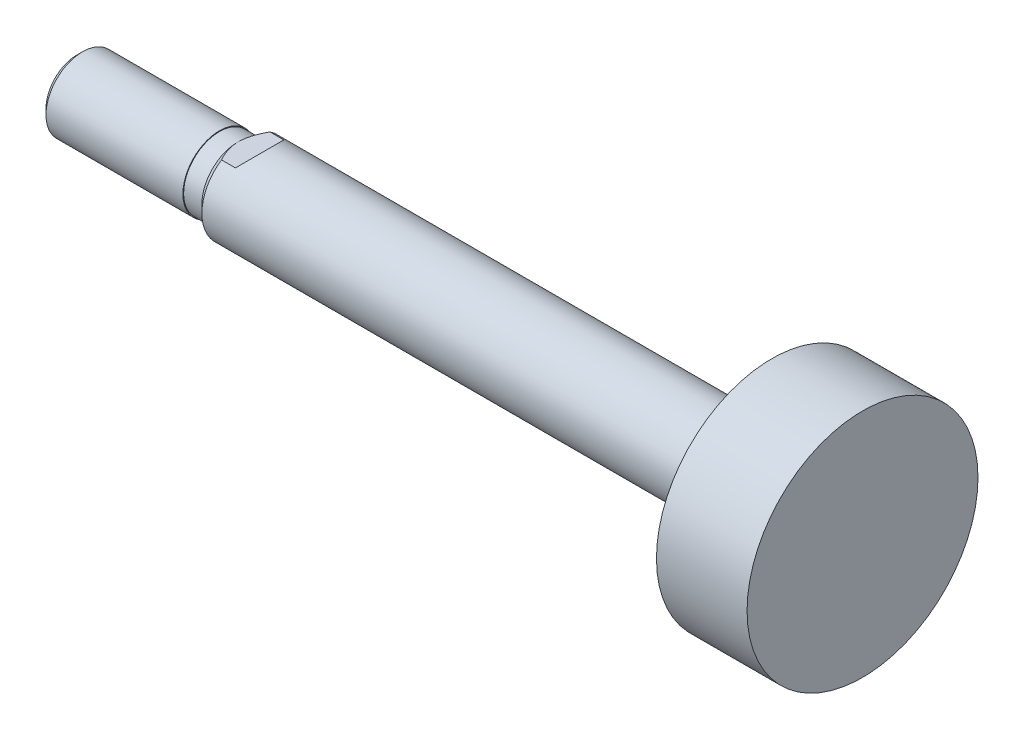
ISO-10303-21;
HEADER;
FILE_DESCRIPTION(('STEP AP214'),'2;1');
FILE_NAME('part.step','',(''),(''),'','','');
FILE_SCHEMA(('AUTOMOTIVE_DESIGN { 1 0 10303 214 1 1 1 1 }'));
ENDSEC;
DATA;
#1=APPLICATION_CONTEXT('core data for automotive mechanical design processes');
#2=APPLICATION_PROTOCOL_DEFINITION('international standard','automotive_design',2000,#1);
#3=PRODUCT_CONTEXT('',#1,'mechanical');
#4=PRODUCT('Part','Part','',(#3));
#5=PRODUCT_RELATED_PRODUCT_CATEGORY('part','',(#4));
#6=PRODUCT_DEFINITION_FORMATION('','',#4);
#7=PRODUCT_DEFINITION_CONTEXT('part definition',#1,'design');
#8=PRODUCT_DEFINITION('design','',#6,#7);
#9=PRODUCT_DEFINITION_SHAPE('','',#8);
#10=(LENGTH_UNIT() NAMED_UNIT(*) SI_UNIT(.MILLI.,.METRE.));
#11=(NAMED_UNIT(*) PLANE_ANGLE_UNIT() SI_UNIT($,.RADIAN.));
#12=(NAMED_UNIT(*) SI_UNIT($,.STERADIAN.) SOLID_ANGLE_UNIT());
#13=UNCERTAINTY_MEASURE_WITH_UNIT(LENGTH_MEASURE(1.E-05),#10,'distance_accuracy_value','');
#14=(GEOMETRIC_REPRESENTATION_CONTEXT(3) GLOBAL_UNCERTAINTY_ASSIGNED_CONTEXT((#13)) GLOBAL_UNIT_ASSIGNED_CONTEXT((#10,
#11,#12)) REPRESENTATION_CONTEXT('',''));
#15=CARTESIAN_POINT('',(0.,0.,0.));
#16=DIRECTION('',(0.,0.,1.));
#17=DIRECTION('',(1.,0.,0.));
#18=AXIS2_PLACEMENT_3D('',#15,#16,#17);
#19=CARTESIAN_POINT('',(-27.,0.,0.));
#20=DIRECTION('',(1.,0.,0.));
#21=DIRECTION('',(0.,0.,-1.));
#22=AXIS2_PLACEMENT_3D('',#19,#20,#21);
#23=PLANE('',#22);
#24=CARTESIAN_POINT('',(-27.,0.,0.));
#25=DIRECTION('',(-1.,0.,0.));
#26=DIRECTION('',(0.,0.,1.));
#27=AXIS2_PLACEMENT_3D('',#24,#25,#26);
#28=CIRCLE('',#27,4.233);
#29=CARTESIAN_POINT('',(-27.,0.,4.233));
#30=VERTEX_POINT('',#29);
#31=EDGE_CURVE('E61',#30,#30,#28,.T.);
#32=ORIENTED_EDGE('',*,*,#31,.T.);
#33=EDGE_LOOP('',(#32));
#34=FACE_BOUND('',#33,.T.);
#35=ADVANCED_FACE('F16',(#34),#23,.F.);
#36=CARTESIAN_POINT('',(-26.233,0.,0.));
#37=DIRECTION('',(1.,0.,0.));
#38=DIRECTION('',(0.,0.,-1.));
#39=AXIS2_PLACEMENT_3D('',#36,#37,#38);
#40=CONICAL_SURFACE('',#39,5.,0.785398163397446);
#41=ORIENTED_EDGE('',*,*,#31,.F.);
#42=EDGE_LOOP('',(#41));
#43=FACE_BOUND('',#42,.T.);
#44=CARTESIAN_POINT('',(-26.233,0.,0.));
#45=DIRECTION('',(-1.,0.,0.));
#46=DIRECTION('',(0.,0.,1.));
#47=AXIS2_PLACEMENT_3D('',#44,#45,#46);
#48=CIRCLE('',#47,5.);
#49=CARTESIAN_POINT('',(-26.233,0.,5.));
#50=VERTEX_POINT('',#49);
#51=EDGE_CURVE('E141',#50,#50,#48,.T.);
#52=ORIENTED_EDGE('',*,*,#51,.T.);
#53=EDGE_LOOP('',(#52));
#54=FACE_BOUND('',#53,.T.);
#55=ADVANCED_FACE('F131',(#43,#54),#40,.T.);
#56=CARTESIAN_POINT('',(80.5,0.,0.));
#57=DIRECTION('',(-1.,0.,0.));
#58=DIRECTION('',(0.,0.,1.));
#59=AXIS2_PLACEMENT_3D('',#56,#57,#58);
#60=CYLINDRICAL_SURFACE('',#59,5.);
#61=ORIENTED_EDGE('',*,*,#51,.F.);
#62=EDGE_LOOP('',(#61));
#63=FACE_BOUND('',#62,.T.);
#64=CARTESIAN_POINT('',(-7.5,0.,0.));
#65=DIRECTION('',(-1.,0.,0.));
#66=DIRECTION('',(0.,0.,1.));
#67=AXIS2_PLACEMENT_3D('',#64,#65,#66);
#68=CIRCLE('',#67,5.);
#69=CARTESIAN_POINT('',(-7.5,0.,5.));
#70=VERTEX_POINT('',#69);
#71=EDGE_CURVE('E144',#70,#70,#68,.T.);
#72=ORIENTED_EDGE('',*,*,#71,.T.);
#73=EDGE_LOOP('',(#72));
#74=FACE_BOUND('',#73,.T.);
#75=ADVANCED_FACE('F137',(#63,#74),#60,.T.);
#76=CARTESIAN_POINT('',(-7.5,5.,0.));
#77=DIRECTION('',(-1.,0.,0.));
#78=DIRECTION('',(0.,0.,1.));
#79=AXIS2_PLACEMENT_3D('',#76,#77,#78);
#80=PLANE('',#79);
#81=ORIENTED_EDGE('',*,*,#71,.F.);
#82=EDGE_LOOP('',(#81));
#83=FACE_BOUND('',#82,.T.);
#84=CARTESIAN_POINT('',(-7.5,0.,0.));
#85=DIRECTION('',(-1.,0.,0.));
#86=DIRECTION('',(0.,0.,1.));
#87=AXIS2_PLACEMENT_3D('',#84,#85,#86);
#88=CIRCLE('',#87,4.9);
#89=CARTESIAN_POINT('',(-7.5,0.,4.9));
#90=VERTEX_POINT('',#89);
#91=EDGE_CURVE('E149',#90,#90,#88,.T.);
#92=ORIENTED_EDGE('',*,*,#91,.T.);
#93=EDGE_LOOP('',(#92));
#94=FACE_BOUND('',#93,.T.);
#95=ADVANCED_FACE('F174',(#83,#94),#80,.F.);
#96=CARTESIAN_POINT('',(80.5,0.,0.));
#97=DIRECTION('',(-1.,0.,0.));
#98=DIRECTION('',(0.,0.,1.));
#99=AXIS2_PLACEMENT_3D('',#96,#97,#98);
#100=CYLINDRICAL_SURFACE('',#99,4.9);
#101=ORIENTED_EDGE('',*,*,#91,.F.);
#102=EDGE_LOOP('',(#101));
#103=FACE_BOUND('',#102,.T.);
#104=CARTESIAN_POINT('',(-5.,0.,0.));
#105=DIRECTION('',(-1.,0.,0.));
#106=DIRECTION('',(0.,0.,1.));
#107=AXIS2_PLACEMENT_3D('',#104,#105,#106);
#108=CIRCLE('',#107,4.9);
#109=CARTESIAN_POINT('',(-5.,0.,4.9));
#110=VERTEX_POINT('',#109);
#111=EDGE_CURVE('E152',#110,#110,#108,.T.);
#112=ORIENTED_EDGE('',*,*,#111,.T.);
#113=EDGE_LOOP('',(#112));
#114=FACE_BOUND('',#113,.T.);
#115=ADVANCED_FACE('F128',(#103,#114),#100,.T.);
#116=CARTESIAN_POINT('',(-3.9,0.,0.));
#117=DIRECTION('',(1.,0.,0.));
#118=DIRECTION('',(0.,0.,-1.));
#119=AXIS2_PLACEMENT_3D('',#116,#117,#118);
#120=CONICAL_SURFACE('',#119,6.,0.785398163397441);
#121=ORIENTED_EDGE('',*,*,#111,.F.);
#122=EDGE_LOOP('',(#121));
#123=FACE_BOUND('',#122,.T.);
#124=CARTESIAN_POINT('',(-3.9,0.,0.));
#125=DIRECTION('',(-1.,0.,0.));
#126=DIRECTION('',(0.,0.,1.));
#127=AXIS2_PLACEMENT_3D('',#124,#125,#126);
#128=CIRCLE('',#127,6.);
#129=CARTESIAN_POINT('',(-3.9,-5.,3.3166247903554));
#130=VERTEX_POINT('',#129);
#131=CARTESIAN_POINT('',(-3.9,5.,3.3166247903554));
#132=VERTEX_POINT('',#131);
#133=EDGE_CURVE('E72',#130,#132,#128,.T.);
#134=ORIENTED_EDGE('',*,*,#133,.T.);
#135=CARTESIAN_POINT('',(1.07892018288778,5.,-9.77428710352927));
#136=CARTESIAN_POINT('',(0.878035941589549,5.,-9.54860982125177));
#137=CARTESIAN_POINT('',(0.677920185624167,5.,-9.32224200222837));
#138=CARTESIAN_POINT('',(0.279635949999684,5.,-8.86775900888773));
#139=CARTESIAN_POINT('',(0.0814676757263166,5.,-8.63964365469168));
#140=CARTESIAN_POINT('',(-0.313308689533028,5.,-8.18036960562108));
#141=CARTESIAN_POINT('',(-0.509906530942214,5.,-7.94920208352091));
#142=CARTESIAN_POINT('',(-0.900051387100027,5.,-7.48432142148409));
#143=CARTESIAN_POINT('',(-1.09359854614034,5.,-7.25060840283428));
#144=CARTESIAN_POINT('',(-1.48835087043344,5.,-6.76585825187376));
#145=CARTESIAN_POINT('',(-1.6893159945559,5.,-6.51462493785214));
#146=CARTESIAN_POINT('',(-2.08546899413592,5.,-6.00765585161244));
#147=CARTESIAN_POINT('',(-2.28065723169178,5.,-5.75192036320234));
#148=CARTESIAN_POINT('',(-2.66290213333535,5.,-5.23506412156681));
#149=CARTESIAN_POINT('',(-2.84997212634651,5.,-4.97395332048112));
#150=CARTESIAN_POINT('',(-3.12233081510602,5.,-4.57668241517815));
#151=CARTESIAN_POINT('',(-3.2117316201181,5.,-4.44334228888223));
#152=CARTESIAN_POINT('',(-3.38723127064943,5.,-4.17451015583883));
#153=CARTESIAN_POINT('',(-3.47333024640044,5.,-4.03901823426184));
#154=CARTESIAN_POINT('',(-3.67534376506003,5.,-3.71068803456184));
#155=CARTESIAN_POINT('',(-3.78935116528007,5.,-3.51666515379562));
#156=CARTESIAN_POINT('',(-4.00718531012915,5.,-3.12284812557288));
#157=CARTESIAN_POINT('',(-4.1110088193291,5.,-2.92305216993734));
#158=CARTESIAN_POINT('',(-4.30424975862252,5.,-2.51866994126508));
#159=CARTESIAN_POINT('',(-4.3937848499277,5.,-2.31414058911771));
#160=CARTESIAN_POINT('',(-4.55522602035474,5.,-1.89821804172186));
#161=CARTESIAN_POINT('',(-4.62714362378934,5.,-1.68682943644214));
#162=CARTESIAN_POINT('',(-4.72886159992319,5.,-1.32670974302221));
#163=CARTESIAN_POINT('',(-4.76476782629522,5.,-1.1797063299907));
#164=CARTESIAN_POINT('',(-4.82465481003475,5.,-0.883274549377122));
#165=CARTESIAN_POINT('',(-4.84863763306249,5.,-0.733846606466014));
#166=CARTESIAN_POINT('',(-4.88340335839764,5.,-0.433971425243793));
#167=CARTESIAN_POINT('',(-4.89423215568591,5.,-0.283529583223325));
#168=CARTESIAN_POINT('',(-4.90223584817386,5.,0.0177243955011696));
#169=CARTESIAN_POINT('',(-4.89941068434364,5.,0.168536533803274));
#170=CARTESIAN_POINT('',(-4.88031719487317,5.,0.468530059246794));
#171=CARTESIAN_POINT('',(-4.86411662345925,5.,0.617715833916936));
#172=CARTESIAN_POINT('',(-4.81922499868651,5.,0.914203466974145));
#173=CARTESIAN_POINT('',(-4.79053097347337,5.,1.06150486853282));
#174=CARTESIAN_POINT('',(-4.72161195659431,5.,1.35510557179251));
#175=CARTESIAN_POINT('',(-4.68126055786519,5.,1.50137483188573));
#176=CARTESIAN_POINT('',(-4.5907626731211,5.,1.79078173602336));
#177=CARTESIAN_POINT('',(-4.5406180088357,5.,1.93391995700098));
#178=CARTESIAN_POINT('',(-4.41376926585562,5.,2.26480330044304));
#179=CARTESIAN_POINT('',(-4.3338135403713,5.,2.45129631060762));
#180=CARTESIAN_POINT('',(-4.16239977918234,5.,2.81895921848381));
#181=CARTESIAN_POINT('',(-4.07093540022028,5.,3.00012611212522));
#182=CARTESIAN_POINT('',(-3.8787622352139,5.,3.35830658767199));
#183=CARTESIAN_POINT('',(-3.77802077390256,5.,3.53530249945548));
#184=CARTESIAN_POINT('',(-3.56958820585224,5.,3.88507768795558));
#185=CARTESIAN_POINT('',(-3.46189845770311,5.,4.05785777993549));
#186=CARTESIAN_POINT('',(-3.24655917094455,5.,4.39131527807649));
#187=CARTESIAN_POINT('',(-3.13917660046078,5.,4.55216598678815));
#188=CARTESIAN_POINT('',(-2.92041956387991,5.,4.87114009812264));
#189=CARTESIAN_POINT('',(-2.80904477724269,5.,5.02926328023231));
#190=CARTESIAN_POINT('',(-2.58406115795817,5.,5.34178281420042));
#191=CARTESIAN_POINT('',(-2.47048084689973,5.,5.49619976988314));
#192=CARTESIAN_POINT('',(-2.24070675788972,5.,5.8030152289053));
#193=CARTESIAN_POINT('',(-2.12451368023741,5.,5.95541425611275));
#194=CARTESIAN_POINT('',(-2.00726604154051,5.,6.10698365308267));
#195=B_SPLINE_CURVE_WITH_KNOTS('',3,(#135,#136,#137,#138,#139,#140,#141,#142,#143,#144,#145,
#146,#147,#148,#149,#150,#151,#152,#153,#154,#155,#156,#157,#158,#159,#160,#161,#162,#163,#164,
#165,#166,#167,#168,#169,#170,#171,#172,#173,#174,#175,#176,#177,#178,#179,#180,#181,#182,#183,
#184,#185,#186,#187,#188,#189,#190,#191,#192,#193,#194),.UNSPECIFIED.,.F.,.F.,(4,2,2,2,2,2,2,2,
2,2,2,2,2,2,2,2,2,2,2,2,2,2,2,2,2,2,2,2,2,4),(0.,0.906406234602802,1.81290705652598,
2.72327150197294,3.63359275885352,4.59869384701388,5.56373431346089,6.52712524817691,
7.0086960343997,7.49024780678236,8.1651272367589,8.84022038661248,9.50943021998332,
10.1782011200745,10.6317572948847,11.0852348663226,11.5371256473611,11.9890183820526,
12.4386359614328,12.8883605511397,13.3431575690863,13.7978700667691,14.4060707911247,
15.0146082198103,15.6253775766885,16.2360278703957,16.8161596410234,17.3963380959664,
17.9713782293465,18.54626602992),.UNSPECIFIED.);
#196=CARTESIAN_POINT('',(-3.9,5.,-3.3166247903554));
#197=VERTEX_POINT('',#196);
#198=EDGE_CURVE('E82',#132,#197,#195,.F.);
#199=ORIENTED_EDGE('',*,*,#198,.T.);
#200=CARTESIAN_POINT('',(-3.9,-5.,-3.3166247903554));
#201=VERTEX_POINT('',#200);
#202=EDGE_CURVE('E155',#197,#201,#128,.T.);
#203=ORIENTED_EDGE('',*,*,#202,.T.);
#204=CARTESIAN_POINT('',(1.07892018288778,-5.,-9.77428710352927));
#205=CARTESIAN_POINT('',(0.878035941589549,-5.,-9.54860982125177));
#206=CARTESIAN_POINT('',(0.677920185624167,-5.,-9.32224200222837));
#207=CARTESIAN_POINT('',(0.279635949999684,-5.,-8.86775900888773));
#208=CARTESIAN_POINT('',(0.0814676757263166,-5.,-8.63964365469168));
#209=CARTESIAN_POINT('',(-0.313308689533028,-5.,-8.18036960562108));
#210=CARTESIAN_POINT('',(-0.509906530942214,-5.,-7.94920208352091));
#211=CARTESIAN_POINT('',(-0.900051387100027,-5.,-7.48432142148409));
#212=CARTESIAN_POINT('',(-1.09359854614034,-5.,-7.25060840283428));
#213=CARTESIAN_POINT('',(-1.48835087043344,-5.,-6.76585825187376));
#214=CARTESIAN_POINT('',(-1.6893159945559,-5.,-6.51462493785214));
#215=CARTESIAN_POINT('',(-2.08546899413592,-5.,-6.00765585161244));
#216=CARTESIAN_POINT('',(-2.28065723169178,-5.,-5.75192036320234));
#217=CARTESIAN_POINT('',(-2.66290213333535,-5.,-5.23506412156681));
#218=CARTESIAN_POINT('',(-2.84997212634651,-5.,-4.97395332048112));
#219=CARTESIAN_POINT('',(-3.12233081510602,-5.,-4.57668241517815));
#220=CARTESIAN_POINT('',(-3.2117316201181,-5.,-4.44334228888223));
#221=CARTESIAN_POINT('',(-3.38723127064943,-5.,-4.17451015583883));
#222=CARTESIAN_POINT('',(-3.47333024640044,-5.,-4.03901823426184));
#223=CARTESIAN_POINT('',(-3.67534376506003,-5.,-3.71068803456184));
#224=CARTESIAN_POINT('',(-3.78935116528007,-5.,-3.51666515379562));
#225=CARTESIAN_POINT('',(-4.00718531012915,-5.,-3.12284812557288));
#226=CARTESIAN_POINT('',(-4.1110088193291,-5.,-2.92305216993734));
#227=CARTESIAN_POINT('',(-4.30424975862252,-5.,-2.51866994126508));
#228=CARTESIAN_POINT('',(-4.3937848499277,-5.,-2.31414058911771));
#229=CARTESIAN_POINT('',(-4.55522602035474,-5.,-1.89821804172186));
#230=CARTESIAN_POINT('',(-4.62714362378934,-5.,-1.68682943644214));
#231=CARTESIAN_POINT('',(-4.72886159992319,-5.,-1.32670974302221));
#232=CARTESIAN_POINT('',(-4.76476782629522,-5.,-1.1797063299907));
#233=CARTESIAN_POINT('',(-4.82465481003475,-5.,-0.883274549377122));
#234=CARTESIAN_POINT('',(-4.84863763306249,-5.,-0.733846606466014));
#235=CARTESIAN_POINT('',(-4.88340335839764,-5.,-0.433971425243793));
#236=CARTESIAN_POINT('',(-4.89423215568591,-5.,-0.283529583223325));
#237=CARTESIAN_POINT('',(-4.90223584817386,-5.,0.0177243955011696));
#238=CARTESIAN_POINT('',(-4.89941068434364,-5.,0.168536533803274));
#239=CARTESIAN_POINT('',(-4.88031719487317,-5.,0.468530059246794));
#240=CARTESIAN_POINT('',(-4.86411662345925,-5.,0.617715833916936));
#241=CARTESIAN_POINT('',(-4.81922499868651,-5.,0.914203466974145));
#242=CARTESIAN_POINT('',(-4.79053097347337,-5.,1.06150486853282));
#243=CARTESIAN_POINT('',(-4.72161195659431,-5.,1.35510557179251));
#244=CARTESIAN_POINT('',(-4.68126055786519,-5.,1.50137483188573));
#245=CARTESIAN_POINT('',(-4.5907626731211,-5.,1.79078173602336));
#246=CARTESIAN_POINT('',(-4.5406180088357,-5.,1.93391995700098));
#247=CARTESIAN_POINT('',(-4.41376926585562,-5.,2.26480330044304));
#248=CARTESIAN_POINT('',(-4.3338135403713,-5.,2.45129631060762));
#249=CARTESIAN_POINT('',(-4.16239977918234,-5.,2.81895921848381));
#250=CARTESIAN_POINT('',(-4.07093540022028,-5.,3.00012611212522));
#251=CARTESIAN_POINT('',(-3.8787622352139,-5.,3.35830658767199));
#252=CARTESIAN_POINT('',(-3.77802077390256,-5.,3.53530249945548));
#253=CARTESIAN_POINT('',(-3.56958820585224,-5.,3.88507768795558));
#254=CARTESIAN_POINT('',(-3.46189845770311,-5.,4.05785777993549));
#255=CARTESIAN_POINT('',(-3.24655917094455,-5.,4.39131527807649));
#256=CARTESIAN_POINT('',(-3.13917660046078,-5.,4.55216598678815));
#257=CARTESIAN_POINT('',(-2.92041956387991,-5.,4.87114009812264));
#258=CARTESIAN_POINT('',(-2.80904477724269,-5.,5.02926328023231));
#259=CARTESIAN_POINT('',(-2.58406115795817,-5.,5.34178281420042));
#260=CARTESIAN_POINT('',(-2.47048084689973,-5.,5.49619976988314));
#261=CARTESIAN_POINT('',(-2.24070675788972,-5.,5.8030152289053));
#262=CARTESIAN_POINT('',(-2.12451368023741,-5.,5.95541425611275));
#263=CARTESIAN_POINT('',(-2.00726604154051,-5.,6.10698365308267));
#264=B_SPLINE_CURVE_WITH_KNOTS('',3,(#204,#205,#206,#207,#208,#209,#210,#211,#212,#213,#214,
#215,#216,#217,#218,#219,#220,#221,#222,#223,#224,#225,#226,#227,#228,#229,#230,#231,#232,#233,
#234,#235,#236,#237,#238,#239,#240,#241,#242,#243,#244,#245,#246,#247,#248,#249,#250,#251,#252,
#253,#254,#255,#256,#257,#258,#259,#260,#261,#262,#263),.UNSPECIFIED.,.F.,.F.,(4,2,2,2,2,2,2,2,
2,2,2,2,2,2,2,2,2,2,2,2,2,2,2,2,2,2,2,2,2,4),(0.,0.906406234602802,1.81290705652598,
2.72327150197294,3.63359275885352,4.59869384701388,5.56373431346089,6.52712524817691,
7.0086960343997,7.49024780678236,8.1651272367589,8.84022038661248,9.50943021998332,
10.1782011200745,10.6317572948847,11.0852348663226,11.5371256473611,11.9890183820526,
12.4386359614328,12.8883605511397,13.3431575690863,13.7978700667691,14.4060707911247,
15.0146082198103,15.6253775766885,16.2360278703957,16.8161596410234,17.3963380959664,
17.9713782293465,18.54626602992),.UNSPECIFIED.);
#265=EDGE_CURVE('E84',#201,#130,#264,.T.);
#266=ORIENTED_EDGE('',*,*,#265,.T.);
#267=EDGE_LOOP('',(#134,#199,#203,#266));
#268=FACE_BOUND('',#267,.T.);
#269=ADVANCED_FACE('F100',(#123,#268),#120,.T.);
#270=CARTESIAN_POINT('',(80.5,0.,0.));
#271=DIRECTION('',(-1.,0.,0.));
#272=DIRECTION('',(0.,0.,1.));
#273=AXIS2_PLACEMENT_3D('',#270,#271,#272);
#274=CYLINDRICAL_SURFACE('',#273,6.);
#275=CARTESIAN_POINT('',(-7.,0.,0.));
#276=DIRECTION('',(0.707106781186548,-0.707106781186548,0.));
#277=DIRECTION('',(-0.707106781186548,-0.707106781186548,0.));
#278=AXIS2_PLACEMENT_3D('',#275,#276,#277);
#279=ELLIPSE('',#278,8.48528137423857,6.);
#280=CARTESIAN_POINT('',(-2.,5.,-3.3166247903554));
#281=VERTEX_POINT('',#280);
#282=CARTESIAN_POINT('',(-2.,5.,3.3166247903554));
#283=VERTEX_POINT('',#282);
#284=EDGE_CURVE('E23',#281,#283,#279,.T.);
#285=ORIENTED_EDGE('',*,*,#284,.T.);
#286=DIRECTION('',(-1.,0.,0.));
#287=VECTOR('',#286,1.);
#288=CARTESIAN_POINT('',(80.5,5.,3.3166247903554));
#289=LINE('',#288,#287);
#290=EDGE_CURVE('E11',#283,#132,#289,.T.);
#291=ORIENTED_EDGE('',*,*,#290,.T.);
#292=ORIENTED_EDGE('',*,*,#133,.F.);
#293=DIRECTION('',(-1.,0.,0.));
#294=VECTOR('',#293,1.);
#295=CARTESIAN_POINT('',(80.5,-5.,3.3166247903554));
#296=LINE('',#295,#294);
#297=CARTESIAN_POINT('',(-2.,-5.,3.31662479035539));
#298=VERTEX_POINT('',#297);
#299=EDGE_CURVE('E65',#130,#298,#296,.F.);
#300=ORIENTED_EDGE('',*,*,#299,.T.);
#301=CARTESIAN_POINT('',(-7.,0.,0.));
#302=DIRECTION('',(0.707106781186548,0.707106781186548,0.));
#303=DIRECTION('',(-0.707106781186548,0.707106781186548,0.));
#304=AXIS2_PLACEMENT_3D('',#301,#302,#303);
#305=ELLIPSE('',#304,8.48528137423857,6.);
#306=CARTESIAN_POINT('',(-2.,-5.,-3.3166247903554));
#307=VERTEX_POINT('',#306);
#308=EDGE_CURVE('E55',#298,#307,#305,.T.);
#309=ORIENTED_EDGE('',*,*,#308,.T.);
#310=DIRECTION('',(-1.,0.,0.));
#311=VECTOR('',#310,1.);
#312=CARTESIAN_POINT('',(80.5,-5.,-3.3166247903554));
#313=LINE('',#312,#311);
#314=EDGE_CURVE('E60',#307,#201,#313,.T.);
#315=ORIENTED_EDGE('',*,*,#314,.T.);
#316=ORIENTED_EDGE('',*,*,#202,.F.);
#317=DIRECTION('',(-1.,0.,0.));
#318=VECTOR('',#317,1.);
#319=CARTESIAN_POINT('',(80.5,5.,-3.3166247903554));
#320=LINE('',#319,#318);
#321=EDGE_CURVE('E73',#197,#281,#320,.F.);
#322=ORIENTED_EDGE('',*,*,#321,.T.);
#323=EDGE_LOOP('',(#285,#291,#292,#300,#309,#315,#316,#322));
#324=FACE_BOUND('',#323,.T.);
#325=CARTESIAN_POINT('',(68.1,0.,0.));
#326=DIRECTION('',(-1.,0.,0.));
#327=DIRECTION('',(0.,0.,1.));
#328=AXIS2_PLACEMENT_3D('',#325,#326,#327);
#329=CIRCLE('',#328,6.);
#330=CARTESIAN_POINT('',(68.1,0.,6.));
#331=VERTEX_POINT('',#330);
#332=EDGE_CURVE('E157',#331,#331,#329,.T.);
#333=ORIENTED_EDGE('',*,*,#332,.T.);
#334=EDGE_LOOP('',(#333));
#335=FACE_BOUND('',#334,.T.);
#336=ADVANCED_FACE('F69',(#324,#335),#274,.T.);
#337=CARTESIAN_POINT('',(68.1,6.,0.));
#338=DIRECTION('',(1.,0.,0.));
#339=DIRECTION('',(0.,0.,-1.));
#340=AXIS2_PLACEMENT_3D('',#337,#338,#339);
#341=PLANE('',#340);
#342=ORIENTED_EDGE('',*,*,#332,.F.);
#343=EDGE_LOOP('',(#342));
#344=FACE_BOUND('',#343,.T.);
#345=CARTESIAN_POINT('',(68.1,0.,0.));
#346=DIRECTION('',(-1.,0.,0.));
#347=DIRECTION('',(0.,0.,1.));
#348=AXIS2_PLACEMENT_3D('',#345,#346,#347);
#349=CIRCLE('',#348,15.8);
#350=CARTESIAN_POINT('',(68.1,0.,15.8));
#351=VERTEX_POINT('',#350);
#352=EDGE_CURVE('E160',#351,#351,#349,.T.);
#353=ORIENTED_EDGE('',*,*,#352,.T.);
#354=EDGE_LOOP('',(#353));
#355=FACE_BOUND('',#354,.T.);
#356=ADVANCED_FACE('F118',(#344,#355),#341,.F.);
#357=CARTESIAN_POINT('',(80.5,0.,0.));
#358=DIRECTION('',(-1.,0.,0.));
#359=DIRECTION('',(0.,0.,1.));
#360=AXIS2_PLACEMENT_3D('',#357,#358,#359);
#361=CYLINDRICAL_SURFACE('',#360,15.8);
#362=ORIENTED_EDGE('',*,*,#352,.F.);
#363=EDGE_LOOP('',(#362));
#364=FACE_BOUND('',#363,.T.);
#365=CARTESIAN_POINT('',(80.5,0.,0.));
#366=DIRECTION('',(-1.,0.,0.));
#367=DIRECTION('',(0.,0.,1.));
#368=AXIS2_PLACEMENT_3D('',#365,#366,#367);
#369=CIRCLE('',#368,15.8);
#370=CARTESIAN_POINT('',(80.5,0.,15.8));
#371=VERTEX_POINT('',#370);
#372=EDGE_CURVE('E162',#371,#371,#369,.T.);
#373=ORIENTED_EDGE('',*,*,#372,.T.);
#374=EDGE_LOOP('',(#373));
#375=FACE_BOUND('',#374,.T.);
#376=ADVANCED_FACE('F114',(#364,#375),#361,.T.);
#377=CARTESIAN_POINT('',(80.5,15.8,0.));
#378=DIRECTION('',(-1.,0.,0.));
#379=DIRECTION('',(0.,0.,1.));
#380=AXIS2_PLACEMENT_3D('',#377,#378,#379);
#381=PLANE('',#380);
#382=ORIENTED_EDGE('',*,*,#372,.F.);
#383=EDGE_LOOP('',(#382));
#384=FACE_BOUND('',#383,.T.);
#385=ADVANCED_FACE('F111',(#384),#381,.F.);
#386=CARTESIAN_POINT('',(-1.,-6.,-12.));
#387=DIRECTION('',(0.707106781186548,0.707106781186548,0.));
#388=DIRECTION('',(-0.707106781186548,0.707106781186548,0.));
#389=AXIS2_PLACEMENT_3D('',#386,#387,#388);
#390=PLANE('',#389);
#391=DIRECTION('',(0.,0.,1.));
#392=VECTOR('',#391,1.);
#393=CARTESIAN_POINT('',(-2.,-5.,-12.));
#394=LINE('',#393,#392);
#395=EDGE_CURVE('E37',#307,#298,#394,.T.);
#396=ORIENTED_EDGE('',*,*,#395,.F.);
#397=ORIENTED_EDGE('',*,*,#308,.F.);
#398=EDGE_LOOP('',(#396,#397));
#399=FACE_BOUND('',#398,.T.);
#400=ADVANCED_FACE('F56',(#399),#390,.F.);
#401=CARTESIAN_POINT('',(-2.,-5.,-12.));
#402=DIRECTION('',(0.,1.,0.));
#403=DIRECTION('',(0.,0.,1.));
#404=AXIS2_PLACEMENT_3D('',#401,#402,#403);
#405=PLANE('',#404);
#406=ORIENTED_EDGE('',*,*,#395,.T.);
#407=ORIENTED_EDGE('',*,*,#299,.F.);
#408=ORIENTED_EDGE('',*,*,#265,.F.);
#409=ORIENTED_EDGE('',*,*,#314,.F.);
#410=EDGE_LOOP('',(#406,#407,#408,#409));
#411=FACE_BOUND('',#410,.T.);
#412=ADVANCED_FACE('F64',(#411),#405,.F.);
#413=CARTESIAN_POINT('',(-2.,5.,-12.));
#414=DIRECTION('',(0.707106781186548,-0.707106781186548,0.));
#415=DIRECTION('',(0.707106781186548,0.707106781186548,0.));
#416=AXIS2_PLACEMENT_3D('',#413,#414,#415);
#417=PLANE('',#416);
#418=DIRECTION('',(0.,0.,1.));
#419=VECTOR('',#418,1.);
#420=CARTESIAN_POINT('',(-2.,5.,-12.));
#421=LINE('',#420,#419);
#422=EDGE_CURVE('E30',#281,#283,#421,.T.);
#423=ORIENTED_EDGE('',*,*,#422,.T.);
#424=ORIENTED_EDGE('',*,*,#284,.F.);
#425=EDGE_LOOP('',(#423,#424));
#426=FACE_BOUND('',#425,.T.);
#427=ADVANCED_FACE('F83',(#426),#417,.F.);
#428=CARTESIAN_POINT('',(-31.,5.,-12.));
#429=DIRECTION('',(0.,-1.,0.));
#430=DIRECTION('',(0.,0.,-1.));
#431=AXIS2_PLACEMENT_3D('',#428,#429,#430);
#432=PLANE('',#431);
#433=ORIENTED_EDGE('',*,*,#422,.F.);
#434=ORIENTED_EDGE('',*,*,#321,.F.);
#435=ORIENTED_EDGE('',*,*,#198,.F.);
#436=ORIENTED_EDGE('',*,*,#290,.F.);
#437=EDGE_LOOP('',(#433,#434,#435,#436));
#438=FACE_BOUND('',#437,.T.);
#439=ADVANCED_FACE('F80',(#438),#432,.F.);
#440=CLOSED_SHELL('',(#35,#55,#75,#95,#115,#269,#336,#356,#376,#385,#400,#412,#427,#439));
#441=MANIFOLD_SOLID_BREP('B1',#440);
#442=ADVANCED_BREP_SHAPE_REPRESENTATION('',(#18,#441),#14);
#443=SHAPE_DEFINITION_REPRESENTATION(#9,#442);
ENDSEC;
END-ISO-10303-21;
